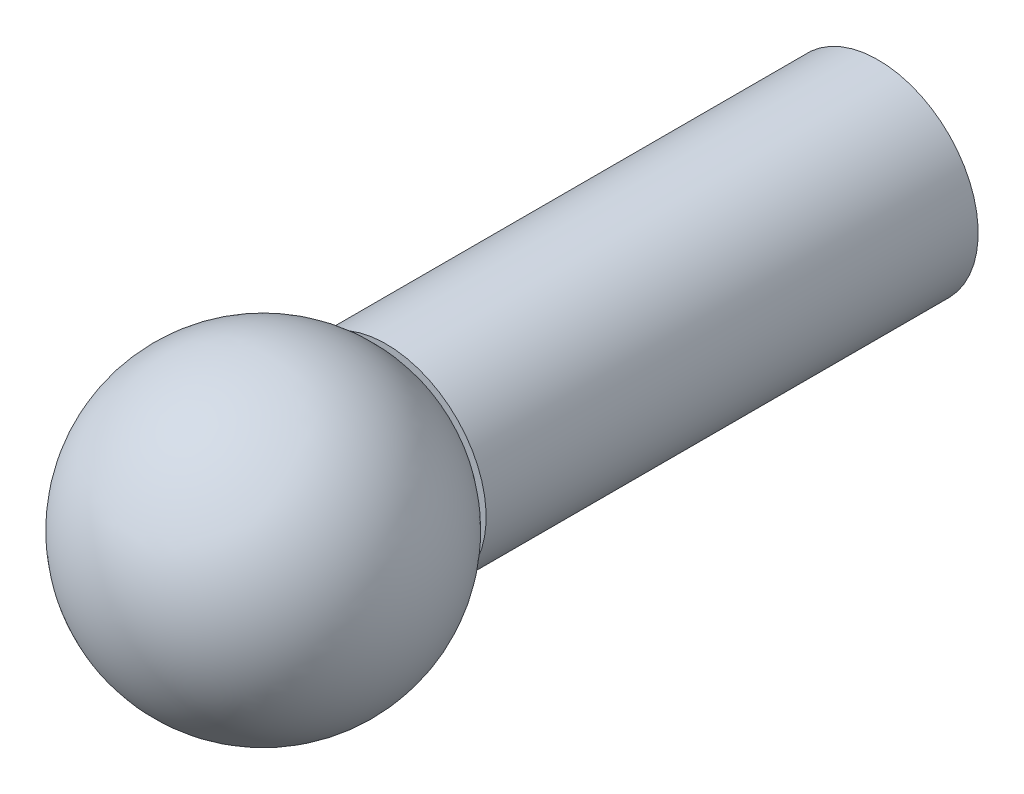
ISO-10303-21;
HEADER;
FILE_DESCRIPTION(('STEP AP214'),'2;1');
FILE_NAME('part.step','',(''),(''),'','','');
FILE_SCHEMA(('AUTOMOTIVE_DESIGN { 1 0 10303 214 1 1 1 1 }'));
ENDSEC;
DATA;
#1=APPLICATION_CONTEXT('core data for automotive mechanical design processes');
#2=APPLICATION_PROTOCOL_DEFINITION('international standard','automotive_design',2000,#1);
#3=PRODUCT_CONTEXT('',#1,'mechanical');
#4=PRODUCT('Part','Part','',(#3));
#5=PRODUCT_RELATED_PRODUCT_CATEGORY('part','',(#4));
#6=PRODUCT_DEFINITION_FORMATION('','',#4);
#7=PRODUCT_DEFINITION_CONTEXT('part definition',#1,'design');
#8=PRODUCT_DEFINITION('design','',#6,#7);
#9=PRODUCT_DEFINITION_SHAPE('','',#8);
#10=(LENGTH_UNIT() NAMED_UNIT(*) SI_UNIT(.MILLI.,.METRE.));
#11=(NAMED_UNIT(*) PLANE_ANGLE_UNIT() SI_UNIT($,.RADIAN.));
#12=(NAMED_UNIT(*) SI_UNIT($,.STERADIAN.) SOLID_ANGLE_UNIT());
#13=UNCERTAINTY_MEASURE_WITH_UNIT(LENGTH_MEASURE(1.E-05),#10,'distance_accuracy_value','');
#14=(GEOMETRIC_REPRESENTATION_CONTEXT(3) GLOBAL_UNCERTAINTY_ASSIGNED_CONTEXT((#13)) GLOBAL_UNIT_ASSIGNED_CONTEXT((#10,
#11,#12)) REPRESENTATION_CONTEXT('',''));
#15=CARTESIAN_POINT('',(0.,0.,0.));
#16=DIRECTION('',(0.,0.,1.));
#17=DIRECTION('',(1.,0.,0.));
#18=AXIS2_PLACEMENT_3D('',#15,#16,#17);
#19=CARTESIAN_POINT('',(0.,0.,32.));
#20=DIRECTION('',(0.,0.,-1.));
#21=DIRECTION('',(-1.,0.,0.));
#22=AXIS2_PLACEMENT_3D('',#19,#20,#21);
#23=PLANE('',#22);
#24=CARTESIAN_POINT('',(0.,0.,32.));
#25=DIRECTION('',(0.,0.,-1.));
#26=DIRECTION('',(-1.,0.,0.));
#27=AXIS2_PLACEMENT_3D('',#24,#25,#26);
#28=CIRCLE('',#27,6.5);
#29=CARTESIAN_POINT('',(-6.5,0.,32.));
#30=VERTEX_POINT('',#29);
#31=EDGE_CURVE('E21',#30,#30,#28,.T.);
#32=ORIENTED_EDGE('',*,*,#31,.F.);
#33=EDGE_LOOP('',(#32));
#34=FACE_BOUND('',#33,.T.);
#35=CARTESIAN_POINT('',(0.,0.,32.));
#36=DIRECTION('',(0.,0.,-1.));
#37=DIRECTION('',(-1.,0.,0.));
#38=AXIS2_PLACEMENT_3D('',#35,#36,#37);
#39=CIRCLE('',#38,6.);
#40=CARTESIAN_POINT('',(-6.,0.,32.));
#41=VERTEX_POINT('',#40);
#42=EDGE_CURVE('E9',#41,#41,#39,.F.);
#43=ORIENTED_EDGE('',*,*,#42,.F.);
#44=EDGE_LOOP('',(#43));
#45=FACE_BOUND('',#44,.T.);
#46=ADVANCED_FACE('F14',(#34,#45),#23,.F.);
#47=CARTESIAN_POINT('',(0.,0.,32.));
#48=DIRECTION('',(0.,0.,-1.));
#49=DIRECTION('',(-1.,0.,0.));
#50=AXIS2_PLACEMENT_3D('',#47,#48,#49);
#51=CYLINDRICAL_SURFACE('',#50,6.5);
#52=ORIENTED_EDGE('',*,*,#31,.T.);
#53=EDGE_LOOP('',(#52));
#54=FACE_BOUND('',#53,.T.);
#55=CARTESIAN_POINT('',(0.,0.,0.));
#56=DIRECTION('',(0.,0.,-1.));
#57=DIRECTION('',(-1.,0.,0.));
#58=AXIS2_PLACEMENT_3D('',#55,#56,#57);
#59=CIRCLE('',#58,6.5);
#60=CARTESIAN_POINT('',(-6.5,0.,0.));
#61=VERTEX_POINT('',#60);
#62=EDGE_CURVE('E37',#61,#61,#59,.T.);
#63=ORIENTED_EDGE('',*,*,#62,.F.);
#64=EDGE_LOOP('',(#63));
#65=FACE_BOUND('',#64,.T.);
#66=ADVANCED_FACE('F16',(#54,#65),#51,.T.);
#67=CARTESIAN_POINT('',(0.,0.,0.));
#68=DIRECTION('',(0.,0.,-1.));
#69=DIRECTION('',(-1.,0.,0.));
#70=AXIS2_PLACEMENT_3D('',#67,#68,#69);
#71=PLANE('',#70);
#72=CARTESIAN_POINT('',(0.,0.,0.));
#73=DIRECTION('',(0.,0.,-1.));
#74=DIRECTION('',(-1.,0.,0.));
#75=AXIS2_PLACEMENT_3D('',#72,#73,#74);
#76=CIRCLE('',#75,3.);
#77=CARTESIAN_POINT('',(-3.,0.,0.));
#78=VERTEX_POINT('',#77);
#79=EDGE_CURVE('E34',#78,#78,#76,.T.);
#80=ORIENTED_EDGE('',*,*,#79,.F.);
#81=EDGE_LOOP('',(#80));
#82=FACE_BOUND('',#81,.T.);
#83=ORIENTED_EDGE('',*,*,#62,.T.);
#84=EDGE_LOOP('',(#83));
#85=FACE_BOUND('',#84,.T.);
#86=ADVANCED_FACE('F59',(#82,#85),#71,.T.);
#87=CARTESIAN_POINT('',(0.,0.,0.));
#88=DIRECTION('',(0.,0.,-1.));
#89=DIRECTION('',(-1.,0.,0.));
#90=AXIS2_PLACEMENT_3D('',#87,#88,#89);
#91=CYLINDRICAL_SURFACE('',#90,3.);
#92=CARTESIAN_POINT('',(0.,0.,11.));
#93=DIRECTION('',(0.,0.,-1.));
#94=DIRECTION('',(-1.,0.,0.));
#95=AXIS2_PLACEMENT_3D('',#92,#93,#94);
#96=CIRCLE('',#95,3.);
#97=CARTESIAN_POINT('',(-3.,0.,11.));
#98=VERTEX_POINT('',#97);
#99=EDGE_CURVE('E32',#98,#98,#96,.T.);
#100=ORIENTED_EDGE('',*,*,#99,.F.);
#101=EDGE_LOOP('',(#100));
#102=FACE_BOUND('',#101,.T.);
#103=ORIENTED_EDGE('',*,*,#79,.T.);
#104=EDGE_LOOP('',(#103));
#105=FACE_BOUND('',#104,.T.);
#106=ADVANCED_FACE('F28',(#102,#105),#91,.F.);
#107=CARTESIAN_POINT('',(0.,0.,11.));
#108=DIRECTION('',(0.,0.,-1.));
#109=DIRECTION('',(-1.,0.,0.));
#110=AXIS2_PLACEMENT_3D('',#107,#108,#109);
#111=CONICAL_SURFACE('',#110,3.,1.02974425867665);
#112=CARTESIAN_POINT('',(0.,0.,12.8025818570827));
#113=VERTEX_POINT('',#112);
#114=VERTEX_LOOP('',#113);
#115=FACE_BOUND('',#114,.T.);
#116=ORIENTED_EDGE('',*,*,#99,.T.);
#117=EDGE_LOOP('',(#116));
#118=FACE_BOUND('',#117,.T.);
#119=ADVANCED_FACE('F24',(#115,#118),#111,.F.);
#120=CARTESIAN_POINT('',(0.,0.,40.));
#121=DIRECTION('',(0.,0.,-1.));
#122=DIRECTION('',(-0.112415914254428,0.993661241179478,0.));
#123=AXIS2_PLACEMENT_3D('',#120,#121,#122);
#124=SPHERICAL_SURFACE('',#123,10.);
#125=ORIENTED_EDGE('',*,*,#42,.T.);
#126=EDGE_LOOP('',(#125));
#127=FACE_BOUND('',#126,.T.);
#128=ADVANCED_FACE('F27',(#127),#124,.T.);
#129=CLOSED_SHELL('',(#46,#66,#86,#106,#119,#128));
#130=MANIFOLD_SOLID_BREP('B1',#129);
#131=ADVANCED_BREP_SHAPE_REPRESENTATION('',(#18,#130),#14);
#132=SHAPE_DEFINITION_REPRESENTATION(#9,#131);
ENDSEC;
END-ISO-10303-21;
